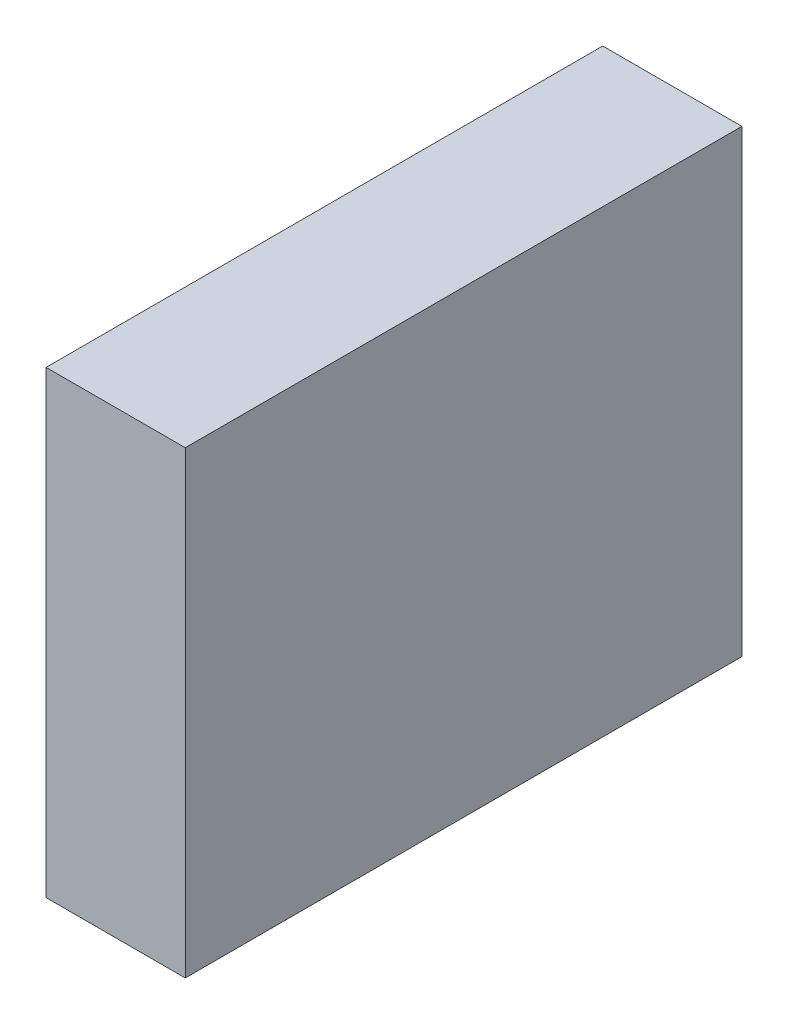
ISO-10303-21;
HEADER;
FILE_DESCRIPTION(('STEP AP214'),'2;1');
FILE_NAME('part.step','',(''),(''),'','','');
FILE_SCHEMA(('AUTOMOTIVE_DESIGN { 1 0 10303 214 1 1 1 1 }'));
ENDSEC;
DATA;
#1=APPLICATION_CONTEXT('core data for automotive mechanical design processes');
#2=APPLICATION_PROTOCOL_DEFINITION('international standard','automotive_design',2000,#1);
#3=PRODUCT_CONTEXT('',#1,'mechanical');
#4=PRODUCT('Part','Part','',(#3));
#5=PRODUCT_RELATED_PRODUCT_CATEGORY('part','',(#4));
#6=PRODUCT_DEFINITION_FORMATION('','',#4);
#7=PRODUCT_DEFINITION_CONTEXT('part definition',#1,'design');
#8=PRODUCT_DEFINITION('design','',#6,#7);
#9=PRODUCT_DEFINITION_SHAPE('','',#8);
#10=(LENGTH_UNIT() NAMED_UNIT(*) SI_UNIT(.MILLI.,.METRE.));
#11=(NAMED_UNIT(*) PLANE_ANGLE_UNIT() SI_UNIT($,.RADIAN.));
#12=(NAMED_UNIT(*) SI_UNIT($,.STERADIAN.) SOLID_ANGLE_UNIT());
#13=UNCERTAINTY_MEASURE_WITH_UNIT(LENGTH_MEASURE(1.E-05),#10,'distance_accuracy_value','');
#14=(GEOMETRIC_REPRESENTATION_CONTEXT(3) GLOBAL_UNCERTAINTY_ASSIGNED_CONTEXT((#13)) GLOBAL_UNIT_ASSIGNED_CONTEXT((#10,
#11,#12)) REPRESENTATION_CONTEXT('',''));
#15=CARTESIAN_POINT('',(0.,0.,0.));
#16=DIRECTION('',(0.,0.,1.));
#17=DIRECTION('',(1.,0.,0.));
#18=AXIS2_PLACEMENT_3D('',#15,#16,#17);
#19=CARTESIAN_POINT('',(0.,8.382,0.));
#20=DIRECTION('',(1.,0.,0.));
#21=DIRECTION('',(0.,0.,-1.));
#22=AXIS2_PLACEMENT_3D('',#19,#20,#21);
#23=PLANE('',#22);
#24=DIRECTION('',(0.,0.,1.));
#25=VECTOR('',#24,1.);
#26=CARTESIAN_POINT('',(0.,0.,0.));
#27=LINE('',#26,#25);
#28=CARTESIAN_POINT('',(0.,0.,-10.16));
#29=VERTEX_POINT('',#28);
#30=CARTESIAN_POINT('',(0.,0.,0.));
#31=VERTEX_POINT('',#30);
#32=EDGE_CURVE('E94',#29,#31,#27,.T.);
#33=ORIENTED_EDGE('',*,*,#32,.T.);
#34=DIRECTION('',(0.,-1.,0.));
#35=VECTOR('',#34,1.);
#36=CARTESIAN_POINT('',(0.,8.382,0.));
#37=LINE('',#36,#35);
#38=CARTESIAN_POINT('',(0.,8.382,0.));
#39=VERTEX_POINT('',#38);
#40=EDGE_CURVE('E11',#39,#31,#37,.T.);
#41=ORIENTED_EDGE('',*,*,#40,.F.);
#42=DIRECTION('',(0.,0.,1.));
#43=VECTOR('',#42,1.);
#44=CARTESIAN_POINT('',(0.,8.382,0.));
#45=LINE('',#44,#43);
#46=CARTESIAN_POINT('',(0.,8.382,-10.16));
#47=VERTEX_POINT('',#46);
#48=EDGE_CURVE('E82',#47,#39,#45,.T.);
#49=ORIENTED_EDGE('',*,*,#48,.F.);
#50=DIRECTION('',(0.,-1.,0.));
#51=VECTOR('',#50,1.);
#52=CARTESIAN_POINT('',(0.,8.382,-10.16));
#53=LINE('',#52,#51);
#54=EDGE_CURVE('E90',#47,#29,#53,.T.);
#55=ORIENTED_EDGE('',*,*,#54,.T.);
#56=EDGE_LOOP('',(#33,#41,#49,#55));
#57=FACE_BOUND('',#56,.T.);
#58=ADVANCED_FACE('F31',(#57),#23,.F.);
#59=CARTESIAN_POINT('',(0.,8.382,0.));
#60=DIRECTION('',(0.,0.,-1.));
#61=DIRECTION('',(-1.,0.,0.));
#62=AXIS2_PLACEMENT_3D('',#59,#60,#61);
#63=PLANE('',#62);
#64=DIRECTION('',(1.,0.,0.));
#65=VECTOR('',#64,1.);
#66=CARTESIAN_POINT('',(0.,0.,0.));
#67=LINE('',#66,#65);
#68=CARTESIAN_POINT('',(2.54,0.,0.));
#69=VERTEX_POINT('',#68);
#70=EDGE_CURVE('E86',#31,#69,#67,.T.);
#71=ORIENTED_EDGE('',*,*,#70,.T.);
#72=DIRECTION('',(0.,-1.,0.));
#73=VECTOR('',#72,1.);
#74=CARTESIAN_POINT('',(2.54,8.382,0.));
#75=LINE('',#74,#73);
#76=CARTESIAN_POINT('',(2.54,8.382,0.));
#77=VERTEX_POINT('',#76);
#78=EDGE_CURVE('E39',#77,#69,#75,.T.);
#79=ORIENTED_EDGE('',*,*,#78,.F.);
#80=DIRECTION('',(1.,0.,0.));
#81=VECTOR('',#80,1.);
#82=CARTESIAN_POINT('',(0.,8.382,0.));
#83=LINE('',#82,#81);
#84=EDGE_CURVE('E77',#39,#77,#83,.T.);
#85=ORIENTED_EDGE('',*,*,#84,.F.);
#86=ORIENTED_EDGE('',*,*,#40,.T.);
#87=EDGE_LOOP('',(#71,#79,#85,#86));
#88=FACE_BOUND('',#87,.T.);
#89=ADVANCED_FACE('F85',(#88),#63,.F.);
#90=CARTESIAN_POINT('',(2.54,8.382,0.));
#91=DIRECTION('',(-1.,0.,0.));
#92=DIRECTION('',(0.,0.,1.));
#93=AXIS2_PLACEMENT_3D('',#90,#91,#92);
#94=PLANE('',#93);
#95=DIRECTION('',(0.,0.,-1.));
#96=VECTOR('',#95,1.);
#97=CARTESIAN_POINT('',(2.54,0.,0.));
#98=LINE('',#97,#96);
#99=CARTESIAN_POINT('',(2.54,0.,-10.16));
#100=VERTEX_POINT('',#99);
#101=EDGE_CURVE('E64',#69,#100,#98,.T.);
#102=ORIENTED_EDGE('',*,*,#101,.T.);
#103=DIRECTION('',(0.,-1.,0.));
#104=VECTOR('',#103,1.);
#105=CARTESIAN_POINT('',(2.54,8.382,-10.16));
#106=LINE('',#105,#104);
#107=CARTESIAN_POINT('',(2.54,8.382,-10.16));
#108=VERTEX_POINT('',#107);
#109=EDGE_CURVE('E87',#108,#100,#106,.T.);
#110=ORIENTED_EDGE('',*,*,#109,.F.);
#111=DIRECTION('',(0.,0.,-1.));
#112=VECTOR('',#111,1.);
#113=CARTESIAN_POINT('',(2.54,8.382,0.));
#114=LINE('',#113,#112);
#115=EDGE_CURVE('E80',#77,#108,#114,.T.);
#116=ORIENTED_EDGE('',*,*,#115,.F.);
#117=ORIENTED_EDGE('',*,*,#78,.T.);
#118=EDGE_LOOP('',(#102,#110,#116,#117));
#119=FACE_BOUND('',#118,.T.);
#120=ADVANCED_FACE('F88',(#119),#94,.F.);
#121=CARTESIAN_POINT('',(0.,8.382,-10.16));
#122=DIRECTION('',(0.,0.,1.));
#123=DIRECTION('',(1.,0.,0.));
#124=AXIS2_PLACEMENT_3D('',#121,#122,#123);
#125=PLANE('',#124);
#126=DIRECTION('',(-1.,0.,0.));
#127=VECTOR('',#126,1.);
#128=CARTESIAN_POINT('',(0.,0.,-10.16));
#129=LINE('',#128,#127);
#130=EDGE_CURVE('E70',#100,#29,#129,.T.);
#131=ORIENTED_EDGE('',*,*,#130,.T.);
#132=ORIENTED_EDGE('',*,*,#54,.F.);
#133=DIRECTION('',(-1.,0.,0.));
#134=VECTOR('',#133,1.);
#135=CARTESIAN_POINT('',(0.,8.382,-10.16));
#136=LINE('',#135,#134);
#137=EDGE_CURVE('E47',#108,#47,#136,.T.);
#138=ORIENTED_EDGE('',*,*,#137,.F.);
#139=ORIENTED_EDGE('',*,*,#109,.T.);
#140=EDGE_LOOP('',(#131,#132,#138,#139));
#141=FACE_BOUND('',#140,.T.);
#142=ADVANCED_FACE('F101',(#141),#125,.F.);
#143=CARTESIAN_POINT('',(0.,8.382,-10.16));
#144=DIRECTION('',(0.,-1.,0.));
#145=DIRECTION('',(0.,0.,-1.));
#146=AXIS2_PLACEMENT_3D('',#143,#144,#145);
#147=PLANE('',#146);
#148=ORIENTED_EDGE('',*,*,#48,.T.);
#149=ORIENTED_EDGE('',*,*,#84,.T.);
#150=ORIENTED_EDGE('',*,*,#115,.T.);
#151=ORIENTED_EDGE('',*,*,#137,.T.);
#152=EDGE_LOOP('',(#148,#149,#150,#151));
#153=FACE_BOUND('',#152,.T.);
#154=ADVANCED_FACE('F78',(#153),#147,.F.);
#155=CARTESIAN_POINT('',(0.,0.,-10.16));
#156=DIRECTION('',(0.,-1.,0.));
#157=DIRECTION('',(0.,0.,-1.));
#158=AXIS2_PLACEMENT_3D('',#155,#156,#157);
#159=PLANE('',#158);
#160=ORIENTED_EDGE('',*,*,#32,.F.);
#161=ORIENTED_EDGE('',*,*,#130,.F.);
#162=ORIENTED_EDGE('',*,*,#101,.F.);
#163=ORIENTED_EDGE('',*,*,#70,.F.);
#164=EDGE_LOOP('',(#160,#161,#162,#163));
#165=FACE_BOUND('',#164,.T.);
#166=ADVANCED_FACE('F104',(#165),#159,.T.);
#167=CLOSED_SHELL('',(#58,#89,#120,#142,#154,#166));
#168=MANIFOLD_SOLID_BREP('B2',#167);
#169=ADVANCED_BREP_SHAPE_REPRESENTATION('',(#18,#168),#14);
#170=SHAPE_DEFINITION_REPRESENTATION(#9,#169);
ENDSEC;
END-ISO-10303-21;
